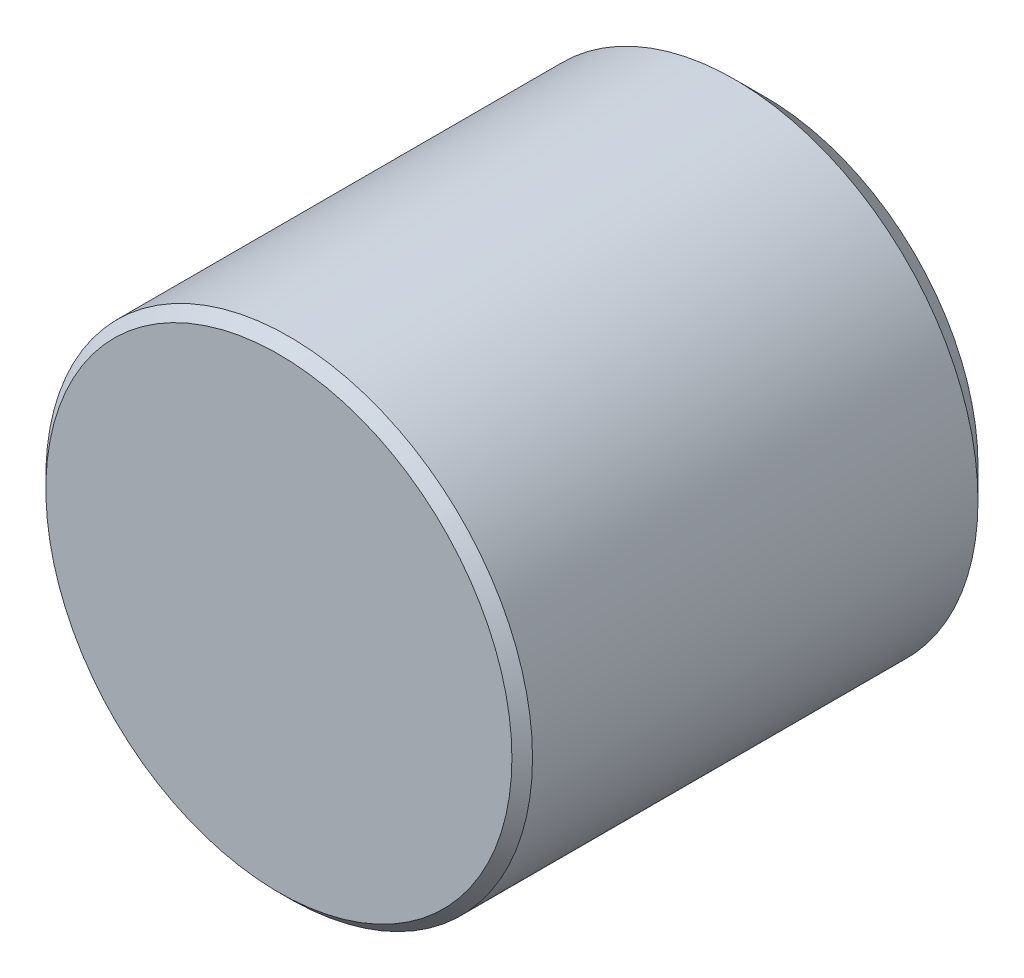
ISO-10303-21;
HEADER;
FILE_DESCRIPTION(('STEP AP214'),'2;1');
FILE_NAME('part.step','',(''),(''),'','','');
FILE_SCHEMA(('AUTOMOTIVE_DESIGN { 1 0 10303 214 1 1 1 1 }'));
ENDSEC;
DATA;
#1=APPLICATION_CONTEXT('core data for automotive mechanical design processes');
#2=APPLICATION_PROTOCOL_DEFINITION('international standard','automotive_design',2000,#1);
#3=PRODUCT_CONTEXT('',#1,'mechanical');
#4=PRODUCT('Part','Part','',(#3));
#5=PRODUCT_RELATED_PRODUCT_CATEGORY('part','',(#4));
#6=PRODUCT_DEFINITION_FORMATION('','',#4);
#7=PRODUCT_DEFINITION_CONTEXT('part definition',#1,'design');
#8=PRODUCT_DEFINITION('design','',#6,#7);
#9=PRODUCT_DEFINITION_SHAPE('','',#8);
#10=(LENGTH_UNIT() NAMED_UNIT(*) SI_UNIT(.MILLI.,.METRE.));
#11=(NAMED_UNIT(*) PLANE_ANGLE_UNIT() SI_UNIT($,.RADIAN.));
#12=(NAMED_UNIT(*) SI_UNIT($,.STERADIAN.) SOLID_ANGLE_UNIT());
#13=UNCERTAINTY_MEASURE_WITH_UNIT(LENGTH_MEASURE(1.E-05),#10,'distance_accuracy_value','');
#14=(GEOMETRIC_REPRESENTATION_CONTEXT(3) GLOBAL_UNCERTAINTY_ASSIGNED_CONTEXT((#13)) GLOBAL_UNIT_ASSIGNED_CONTEXT((#10,
#11,#12)) REPRESENTATION_CONTEXT('',''));
#15=CARTESIAN_POINT('',(0.,0.,0.));
#16=DIRECTION('',(0.,0.,1.));
#17=DIRECTION('',(1.,0.,0.));
#18=AXIS2_PLACEMENT_3D('',#15,#16,#17);
#19=CARTESIAN_POINT('',(0.,0.,0.));
#20=DIRECTION('',(0.,0.,1.));
#21=DIRECTION('',(1.,0.,0.));
#22=AXIS2_PLACEMENT_3D('',#19,#20,#21);
#23=PLANE('',#22);
#24=CARTESIAN_POINT('',(0.,0.,0.));
#25=DIRECTION('',(0.,0.,-1.));
#26=DIRECTION('',(-1.,0.,0.));
#27=AXIS2_PLACEMENT_3D('',#24,#25,#26);
#28=CIRCLE('',#27,2.5);
#29=CARTESIAN_POINT('',(-2.5,0.,0.));
#30=VERTEX_POINT('',#29);
#31=EDGE_CURVE('E33',#30,#30,#28,.T.);
#32=ORIENTED_EDGE('',*,*,#31,.F.);
#33=EDGE_LOOP('',(#32));
#34=FACE_BOUND('',#33,.T.);
#35=CARTESIAN_POINT('',(0.,0.,0.));
#36=DIRECTION('',(0.,0.,1.));
#37=DIRECTION('',(1.,0.,0.));
#38=AXIS2_PLACEMENT_3D('',#35,#36,#37);
#39=CIRCLE('',#38,5.238);
#40=CARTESIAN_POINT('',(5.238,0.,0.));
#41=VERTEX_POINT('',#40);
#42=EDGE_CURVE('E23',#41,#41,#39,.F.);
#43=ORIENTED_EDGE('',*,*,#42,.T.);
#44=EDGE_LOOP('',(#43));
#45=FACE_BOUND('',#44,.T.);
#46=ADVANCED_FACE('F12',(#34,#45),#23,.F.);
#47=CARTESIAN_POINT('',(0.,0.,12.));
#48=DIRECTION('',(0.,0.,-1.));
#49=DIRECTION('',(-1.,0.,0.));
#50=AXIS2_PLACEMENT_3D('',#47,#48,#49);
#51=CYLINDRICAL_SURFACE('',#50,6.);
#52=CARTESIAN_POINT('',(0.,0.,11.746));
#53=DIRECTION('',(0.,0.,1.));
#54=DIRECTION('',(1.,0.,0.));
#55=AXIS2_PLACEMENT_3D('',#52,#53,#54);
#56=CIRCLE('',#55,6.);
#57=CARTESIAN_POINT('',(6.,0.,11.746));
#58=VERTEX_POINT('',#57);
#59=EDGE_CURVE('E8',#58,#58,#56,.F.);
#60=ORIENTED_EDGE('',*,*,#59,.T.);
#61=EDGE_LOOP('',(#60));
#62=FACE_BOUND('',#61,.T.);
#63=CARTESIAN_POINT('',(0.,0.,0.762));
#64=DIRECTION('',(0.,0.,1.));
#65=DIRECTION('',(1.,0.,0.));
#66=AXIS2_PLACEMENT_3D('',#63,#64,#65);
#67=CIRCLE('',#66,6.);
#68=CARTESIAN_POINT('',(6.,0.,0.762));
#69=VERTEX_POINT('',#68);
#70=EDGE_CURVE('E27',#69,#69,#67,.T.);
#71=ORIENTED_EDGE('',*,*,#70,.T.);
#72=EDGE_LOOP('',(#71));
#73=FACE_BOUND('',#72,.T.);
#74=ADVANCED_FACE('F49',(#62,#73),#51,.T.);
#75=CARTESIAN_POINT('',(0.,0.,12.));
#76=DIRECTION('',(0.,0.,1.));
#77=DIRECTION('',(1.,0.,0.));
#78=AXIS2_PLACEMENT_3D('',#75,#76,#77);
#79=PLANE('',#78);
#80=CARTESIAN_POINT('',(0.,0.,12.));
#81=DIRECTION('',(0.,0.,1.));
#82=DIRECTION('',(1.,0.,0.));
#83=AXIS2_PLACEMENT_3D('',#80,#81,#82);
#84=CIRCLE('',#83,5.746);
#85=CARTESIAN_POINT('',(5.746,0.,12.));
#86=VERTEX_POINT('',#85);
#87=EDGE_CURVE('E19',#86,#86,#84,.T.);
#88=ORIENTED_EDGE('',*,*,#87,.T.);
#89=EDGE_LOOP('',(#88));
#90=FACE_BOUND('',#89,.T.);
#91=ADVANCED_FACE('F56',(#90),#79,.T.);
#92=CARTESIAN_POINT('',(0.,0.,0.762));
#93=DIRECTION('',(0.,0.,1.));
#94=DIRECTION('',(1.,0.,0.));
#95=AXIS2_PLACEMENT_3D('',#92,#93,#94);
#96=CONICAL_SURFACE('',#95,6.,0.78539816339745);
#97=ORIENTED_EDGE('',*,*,#42,.F.);
#98=EDGE_LOOP('',(#97));
#99=FACE_BOUND('',#98,.T.);
#100=ORIENTED_EDGE('',*,*,#70,.F.);
#101=EDGE_LOOP('',(#100));
#102=FACE_BOUND('',#101,.T.);
#103=ADVANCED_FACE('F53',(#99,#102),#96,.T.);
#104=CARTESIAN_POINT('',(0.,0.,12.));
#105=DIRECTION('',(0.,0.,-1.));
#106=DIRECTION('',(-1.,0.,0.));
#107=AXIS2_PLACEMENT_3D('',#104,#105,#106);
#108=CONICAL_SURFACE('',#107,5.746,0.78539816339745);
#109=ORIENTED_EDGE('',*,*,#59,.F.);
#110=EDGE_LOOP('',(#109));
#111=FACE_BOUND('',#110,.T.);
#112=ORIENTED_EDGE('',*,*,#87,.F.);
#113=EDGE_LOOP('',(#112));
#114=FACE_BOUND('',#113,.T.);
#115=ADVANCED_FACE('F14',(#111,#114),#108,.T.);
#116=CARTESIAN_POINT('',(0.,0.,6.4));
#117=DIRECTION('',(0.,0.,-1.));
#118=DIRECTION('',(-1.,0.,0.));
#119=AXIS2_PLACEMENT_3D('',#116,#117,#118);
#120=CYLINDRICAL_SURFACE('',#119,2.5);
#121=CARTESIAN_POINT('',(0.,0.,6.4));
#122=DIRECTION('',(0.,0.,-1.));
#123=DIRECTION('',(-1.,0.,0.));
#124=AXIS2_PLACEMENT_3D('',#121,#122,#123);
#125=CIRCLE('',#124,2.5);
#126=CARTESIAN_POINT('',(-2.5,0.,6.4));
#127=VERTEX_POINT('',#126);
#128=EDGE_CURVE('E32',#127,#127,#125,.T.);
#129=ORIENTED_EDGE('',*,*,#128,.F.);
#130=EDGE_LOOP('',(#129));
#131=FACE_BOUND('',#130,.T.);
#132=ORIENTED_EDGE('',*,*,#31,.T.);
#133=EDGE_LOOP('',(#132));
#134=FACE_BOUND('',#133,.T.);
#135=ADVANCED_FACE('F41',(#131,#134),#120,.F.);
#136=CARTESIAN_POINT('',(0.,0.,6.4));
#137=DIRECTION('',(0.,0.,-1.));
#138=DIRECTION('',(-1.,0.,0.));
#139=AXIS2_PLACEMENT_3D('',#136,#137,#138);
#140=PLANE('',#139);
#141=ORIENTED_EDGE('',*,*,#128,.T.);
#142=EDGE_LOOP('',(#141));
#143=FACE_BOUND('',#142,.T.);
#144=ADVANCED_FACE('F39',(#143),#140,.T.);
#145=CLOSED_SHELL('',(#46,#74,#91,#103,#115,#135,#144));
#146=MANIFOLD_SOLID_BREP('B1',#145);
#147=ADVANCED_BREP_SHAPE_REPRESENTATION('',(#18,#146),#14);
#148=SHAPE_DEFINITION_REPRESENTATION(#9,#147);
ENDSEC;
END-ISO-10303-21;
